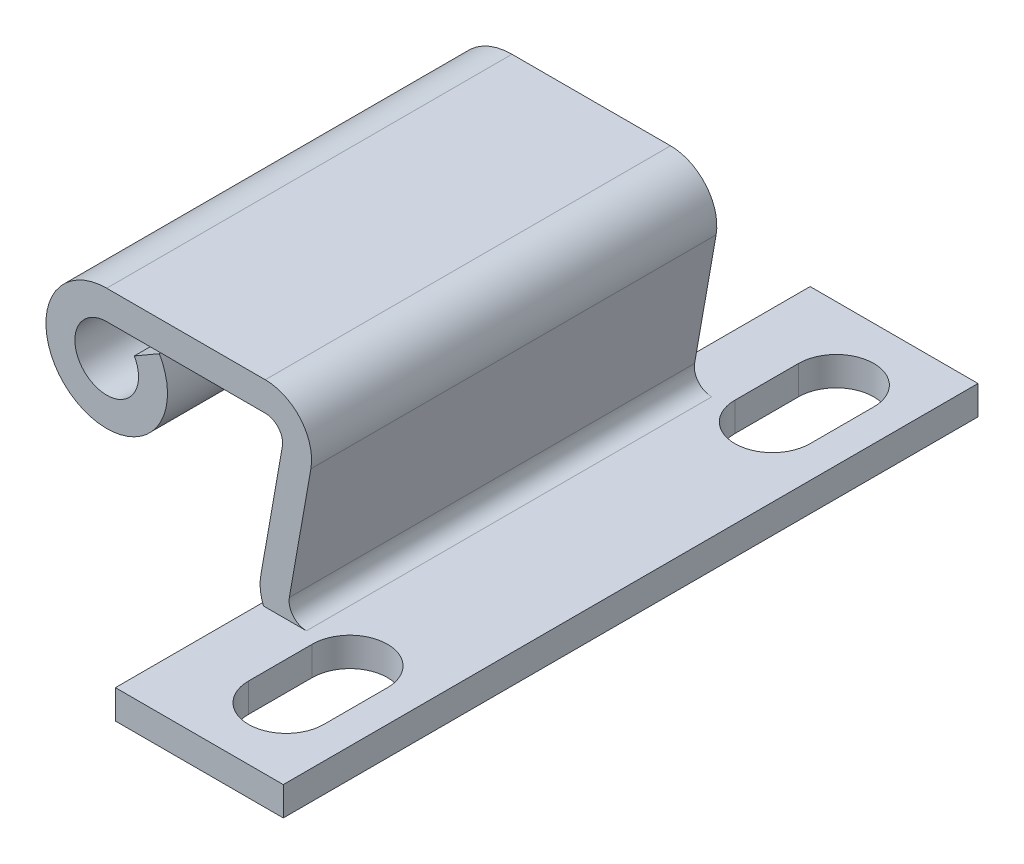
ISO-10303-21;
HEADER;
FILE_DESCRIPTION(('STEP AP214'),'2;1');
FILE_NAME('part.step','',(''),(''),'','','');
FILE_SCHEMA(('AUTOMOTIVE_DESIGN { 1 0 10303 214 1 1 1 1 }'));
ENDSEC;
DATA;
#1=APPLICATION_CONTEXT('core data for automotive mechanical design processes');
#2=APPLICATION_PROTOCOL_DEFINITION('international standard','automotive_design',2000,#1);
#3=PRODUCT_CONTEXT('',#1,'mechanical');
#4=PRODUCT('Part','Part','',(#3));
#5=PRODUCT_RELATED_PRODUCT_CATEGORY('part','',(#4));
#6=PRODUCT_DEFINITION_FORMATION('','',#4);
#7=PRODUCT_DEFINITION_CONTEXT('part definition',#1,'design');
#8=PRODUCT_DEFINITION('design','',#6,#7);
#9=PRODUCT_DEFINITION_SHAPE('','',#8);
#10=(LENGTH_UNIT() NAMED_UNIT(*) SI_UNIT(.MILLI.,.METRE.));
#11=(NAMED_UNIT(*) PLANE_ANGLE_UNIT() SI_UNIT($,.RADIAN.));
#12=(NAMED_UNIT(*) SI_UNIT($,.STERADIAN.) SOLID_ANGLE_UNIT());
#13=UNCERTAINTY_MEASURE_WITH_UNIT(LENGTH_MEASURE(1.E-05),#10,'distance_accuracy_value','');
#14=(GEOMETRIC_REPRESENTATION_CONTEXT(3) GLOBAL_UNCERTAINTY_ASSIGNED_CONTEXT((#13)) GLOBAL_UNIT_ASSIGNED_CONTEXT((#10,
#11,#12)) REPRESENTATION_CONTEXT('',''));
#15=CARTESIAN_POINT('',(0.,0.,0.));
#16=DIRECTION('',(0.,0.,1.));
#17=DIRECTION('',(1.,0.,0.));
#18=AXIS2_PLACEMENT_3D('',#15,#16,#17);
#19=CARTESIAN_POINT('',(17.25,-11.75,30.));
#20=DIRECTION('',(0.,1.,0.));
#21=DIRECTION('',(0.,0.,1.));
#22=AXIS2_PLACEMENT_3D('',#19,#20,#21);
#23=PLANE('',#22);
#24=DIRECTION('',(0.,0.,-1.));
#25=VECTOR('',#24,1.);
#26=CARTESIAN_POINT('',(27.75,-11.75,30.));
#27=LINE('',#26,#25);
#28=CARTESIAN_POINT('',(27.75,-11.75,30.));
#29=VERTEX_POINT('',#28);
#30=CARTESIAN_POINT('',(27.75,-11.75,-30.));
#31=VERTEX_POINT('',#30);
#32=EDGE_CURVE('E21',#29,#31,#27,.T.);
#33=ORIENTED_EDGE('',*,*,#32,.T.);
#34=DIRECTION('',(1.,0.,0.));
#35=VECTOR('',#34,1.);
#36=CARTESIAN_POINT('',(17.25,-11.75,-30.));
#37=LINE('',#36,#35);
#38=CARTESIAN_POINT('',(13.25,-11.75,-30.));
#39=VERTEX_POINT('',#38);
#40=EDGE_CURVE('E317',#39,#31,#37,.T.);
#41=ORIENTED_EDGE('',*,*,#40,.F.);
#42=DIRECTION('',(0.,0.,1.));
#43=VECTOR('',#42,1.);
#44=CARTESIAN_POINT('',(13.25,-11.75,-30.));
#45=LINE('',#44,#43);
#46=CARTESIAN_POINT('',(13.25,-11.75,30.));
#47=VERTEX_POINT('',#46);
#48=EDGE_CURVE('E247',#39,#47,#45,.T.);
#49=ORIENTED_EDGE('',*,*,#48,.T.);
#50=DIRECTION('',(1.,0.,0.));
#51=VECTOR('',#50,1.);
#52=CARTESIAN_POINT('',(17.25,-11.75,30.));
#53=LINE('',#52,#51);
#54=EDGE_CURVE('E326',#47,#29,#53,.T.);
#55=ORIENTED_EDGE('',*,*,#54,.T.);
#56=EDGE_LOOP('',(#33,#41,#49,#55));
#57=FACE_BOUND('',#56,.T.);
#58=DIRECTION('',(0.,0.,-1.));
#59=VECTOR('',#58,1.);
#60=CARTESIAN_POINT('',(13.5419007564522,-11.75,30.));
#61=LINE('',#60,#59);
#62=CARTESIAN_POINT('',(13.5419007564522,-11.75,-17.5));
#63=VERTEX_POINT('',#62);
#64=CARTESIAN_POINT('',(13.5419007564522,-11.75,17.5));
#65=VERTEX_POINT('',#64);
#66=EDGE_CURVE('E253',#63,#65,#61,.F.);
#67=ORIENTED_EDGE('',*,*,#66,.F.);
#68=DIRECTION('',(1.,0.,0.));
#69=VECTOR('',#68,1.);
#70=CARTESIAN_POINT('',(-5.25,-11.75,-17.5));
#71=LINE('',#70,#69);
#72=CARTESIAN_POINT('',(17.25,-11.75,-17.5));
#73=VERTEX_POINT('',#72);
#74=EDGE_CURVE('E255',#63,#73,#71,.T.);
#75=ORIENTED_EDGE('',*,*,#74,.T.);
#76=DIRECTION('',(0.,0.,-1.));
#77=VECTOR('',#76,1.);
#78=CARTESIAN_POINT('',(17.25,-11.75,30.));
#79=LINE('',#78,#77);
#80=CARTESIAN_POINT('',(17.25,-11.75,17.5));
#81=VERTEX_POINT('',#80);
#82=EDGE_CURVE('E361',#81,#73,#79,.T.);
#83=ORIENTED_EDGE('',*,*,#82,.F.);
#84=DIRECTION('',(1.,0.,0.));
#85=VECTOR('',#84,1.);
#86=CARTESIAN_POINT('',(-5.25,-11.75,17.5));
#87=LINE('',#86,#85);
#88=EDGE_CURVE('E285',#65,#81,#87,.T.);
#89=ORIENTED_EDGE('',*,*,#88,.F.);
#90=EDGE_LOOP('',(#67,#75,#83,#89));
#91=FACE_BOUND('',#90,.T.);
#92=CARTESIAN_POINT('',(21.75,-11.75,18.25));
#93=DIRECTION('',(0.,1.,0.));
#94=DIRECTION('',(0.,0.,1.));
#95=AXIS2_PLACEMENT_3D('',#92,#93,#94);
#96=CIRCLE('',#95,3.25);
#97=CARTESIAN_POINT('',(25.,-11.75,18.25));
#98=VERTEX_POINT('',#97);
#99=CARTESIAN_POINT('',(18.5,-11.75,18.25));
#100=VERTEX_POINT('',#99);
#101=EDGE_CURVE('E239',#98,#100,#96,.T.);
#102=ORIENTED_EDGE('',*,*,#101,.F.);
#103=DIRECTION('',(0.,0.,-1.));
#104=VECTOR('',#103,1.);
#105=CARTESIAN_POINT('',(25.,-11.75,30.));
#106=LINE('',#105,#104);
#107=CARTESIAN_POINT('',(25.,-11.75,23.75));
#108=VERTEX_POINT('',#107);
#109=EDGE_CURVE('E231',#108,#98,#106,.T.);
#110=ORIENTED_EDGE('',*,*,#109,.F.);
#111=CARTESIAN_POINT('',(21.75,-11.75,23.75));
#112=DIRECTION('',(0.,1.,0.));
#113=DIRECTION('',(0.,0.,1.));
#114=AXIS2_PLACEMENT_3D('',#111,#112,#113);
#115=CIRCLE('',#114,3.25);
#116=CARTESIAN_POINT('',(18.5,-11.75,23.75));
#117=VERTEX_POINT('',#116);
#118=EDGE_CURVE('E233',#117,#108,#115,.T.);
#119=ORIENTED_EDGE('',*,*,#118,.F.);
#120=DIRECTION('',(0.,0.,-1.));
#121=VECTOR('',#120,1.);
#122=CARTESIAN_POINT('',(18.5,-11.75,30.));
#123=LINE('',#122,#121);
#124=EDGE_CURVE('E236',#117,#100,#123,.T.);
#125=ORIENTED_EDGE('',*,*,#124,.T.);
#126=EDGE_LOOP('',(#102,#110,#119,#125));
#127=FACE_BOUND('',#126,.T.);
#128=DIRECTION('',(0.,0.,1.));
#129=VECTOR('',#128,1.);
#130=CARTESIAN_POINT('',(18.5,-11.75,30.));
#131=LINE('',#130,#129);
#132=CARTESIAN_POINT('',(18.5,-11.75,-23.75));
#133=VERTEX_POINT('',#132);
#134=CARTESIAN_POINT('',(18.5,-11.75,-18.25));
#135=VERTEX_POINT('',#134);
#136=EDGE_CURVE('E208',#133,#135,#131,.T.);
#137=ORIENTED_EDGE('',*,*,#136,.F.);
#138=CARTESIAN_POINT('',(21.75,-11.75,-23.75));
#139=DIRECTION('',(0.,1.,0.));
#140=DIRECTION('',(0.,0.,1.));
#141=AXIS2_PLACEMENT_3D('',#138,#139,#140);
#142=CIRCLE('',#141,3.25);
#143=CARTESIAN_POINT('',(25.,-11.75,-23.75));
#144=VERTEX_POINT('',#143);
#145=EDGE_CURVE('E177',#133,#144,#142,.F.);
#146=ORIENTED_EDGE('',*,*,#145,.T.);
#147=DIRECTION('',(0.,0.,1.));
#148=VECTOR('',#147,1.);
#149=CARTESIAN_POINT('',(25.,-11.75,30.));
#150=LINE('',#149,#148);
#151=CARTESIAN_POINT('',(25.,-11.75,-18.25));
#152=VERTEX_POINT('',#151);
#153=EDGE_CURVE('E180',#144,#152,#150,.T.);
#154=ORIENTED_EDGE('',*,*,#153,.T.);
#155=CARTESIAN_POINT('',(21.75,-11.75,-18.25));
#156=DIRECTION('',(0.,1.,0.));
#157=DIRECTION('',(0.,0.,1.));
#158=AXIS2_PLACEMENT_3D('',#155,#156,#157);
#159=CIRCLE('',#158,3.25);
#160=EDGE_CURVE('E205',#152,#135,#159,.F.);
#161=ORIENTED_EDGE('',*,*,#160,.T.);
#162=EDGE_LOOP('',(#137,#146,#154,#161));
#163=FACE_BOUND('',#162,.T.);
#164=ADVANCED_FACE('F14',(#57,#91,#127,#163),#23,.T.);
#165=CARTESIAN_POINT('',(17.25,-14.25,30.));
#166=DIRECTION('',(0.,1.,0.));
#167=DIRECTION('',(0.,0.,1.));
#168=AXIS2_PLACEMENT_3D('',#165,#166,#167);
#169=PLANE('',#168);
#170=DIRECTION('',(1.,0.,0.));
#171=VECTOR('',#170,1.);
#172=CARTESIAN_POINT('',(17.25,-14.25,30.));
#173=LINE('',#172,#171);
#174=CARTESIAN_POINT('',(13.25,-14.25,30.));
#175=VERTEX_POINT('',#174);
#176=CARTESIAN_POINT('',(27.75,-14.25,30.));
#177=VERTEX_POINT('',#176);
#178=EDGE_CURVE('E323',#175,#177,#173,.T.);
#179=ORIENTED_EDGE('',*,*,#178,.F.);
#180=DIRECTION('',(0.,0.,1.));
#181=VECTOR('',#180,1.);
#182=CARTESIAN_POINT('',(13.25,-14.25,-30.));
#183=LINE('',#182,#181);
#184=CARTESIAN_POINT('',(13.25,-14.25,-30.));
#185=VERTEX_POINT('',#184);
#186=EDGE_CURVE('E250',#185,#175,#183,.T.);
#187=ORIENTED_EDGE('',*,*,#186,.F.);
#188=DIRECTION('',(1.,0.,0.));
#189=VECTOR('',#188,1.);
#190=CARTESIAN_POINT('',(17.25,-14.25,-30.));
#191=LINE('',#190,#189);
#192=CARTESIAN_POINT('',(27.75,-14.25,-30.));
#193=VERTEX_POINT('',#192);
#194=EDGE_CURVE('E314',#185,#193,#191,.T.);
#195=ORIENTED_EDGE('',*,*,#194,.T.);
#196=DIRECTION('',(0.,0.,-1.));
#197=VECTOR('',#196,1.);
#198=CARTESIAN_POINT('',(27.75,-14.25,30.));
#199=LINE('',#198,#197);
#200=EDGE_CURVE('E329',#177,#193,#199,.T.);
#201=ORIENTED_EDGE('',*,*,#200,.F.);
#202=EDGE_LOOP('',(#179,#187,#195,#201));
#203=FACE_BOUND('',#202,.T.);
#204=DIRECTION('',(0.,0.,1.));
#205=VECTOR('',#204,1.);
#206=CARTESIAN_POINT('',(25.,-14.25,18.25));
#207=LINE('',#206,#205);
#208=CARTESIAN_POINT('',(25.,-14.25,18.25));
#209=VERTEX_POINT('',#208);
#210=CARTESIAN_POINT('',(25.,-14.25,23.75));
#211=VERTEX_POINT('',#210);
#212=EDGE_CURVE('E213',#209,#211,#207,.T.);
#213=ORIENTED_EDGE('',*,*,#212,.F.);
#214=CARTESIAN_POINT('',(21.75,-14.25,18.25));
#215=DIRECTION('',(0.,-1.,0.));
#216=DIRECTION('',(0.,0.,-1.));
#217=AXIS2_PLACEMENT_3D('',#214,#215,#216);
#218=CIRCLE('',#217,3.25);
#219=CARTESIAN_POINT('',(18.5,-14.25,18.25));
#220=VERTEX_POINT('',#219);
#221=EDGE_CURVE('E211',#220,#209,#218,.T.);
#222=ORIENTED_EDGE('',*,*,#221,.F.);
#223=DIRECTION('',(0.,0.,1.));
#224=VECTOR('',#223,1.);
#225=CARTESIAN_POINT('',(18.5,-14.25,18.25));
#226=LINE('',#225,#224);
#227=CARTESIAN_POINT('',(18.5,-14.25,23.75));
#228=VERTEX_POINT('',#227);
#229=EDGE_CURVE('E219',#220,#228,#226,.T.);
#230=ORIENTED_EDGE('',*,*,#229,.T.);
#231=CARTESIAN_POINT('',(21.75,-14.25,23.75));
#232=DIRECTION('',(0.,-1.,0.));
#233=DIRECTION('',(0.,0.,-1.));
#234=AXIS2_PLACEMENT_3D('',#231,#232,#233);
#235=CIRCLE('',#234,3.25);
#236=EDGE_CURVE('E216',#211,#228,#235,.T.);
#237=ORIENTED_EDGE('',*,*,#236,.F.);
#238=EDGE_LOOP('',(#213,#222,#230,#237));
#239=FACE_BOUND('',#238,.T.);
#240=CARTESIAN_POINT('',(21.75,-14.25,-23.75));
#241=DIRECTION('',(0.,1.,0.));
#242=DIRECTION('',(0.,0.,1.));
#243=AXIS2_PLACEMENT_3D('',#240,#241,#242);
#244=CIRCLE('',#243,3.25);
#245=CARTESIAN_POINT('',(25.,-14.25,-23.75));
#246=VERTEX_POINT('',#245);
#247=CARTESIAN_POINT('',(18.5,-14.25,-23.75));
#248=VERTEX_POINT('',#247);
#249=EDGE_CURVE('E36',#246,#248,#244,.T.);
#250=ORIENTED_EDGE('',*,*,#249,.T.);
#251=DIRECTION('',(0.,0.,-1.));
#252=VECTOR('',#251,1.);
#253=CARTESIAN_POINT('',(18.5,-14.25,-18.25));
#254=LINE('',#253,#252);
#255=CARTESIAN_POINT('',(18.5,-14.25,-18.25));
#256=VERTEX_POINT('',#255);
#257=EDGE_CURVE('E184',#256,#248,#254,.T.);
#258=ORIENTED_EDGE('',*,*,#257,.F.);
#259=CARTESIAN_POINT('',(21.75,-14.25,-18.25));
#260=DIRECTION('',(0.,1.,0.));
#261=DIRECTION('',(0.,0.,1.));
#262=AXIS2_PLACEMENT_3D('',#259,#260,#261);
#263=CIRCLE('',#262,3.25);
#264=CARTESIAN_POINT('',(25.,-14.25,-18.25));
#265=VERTEX_POINT('',#264);
#266=EDGE_CURVE('E190',#256,#265,#263,.T.);
#267=ORIENTED_EDGE('',*,*,#266,.T.);
#268=DIRECTION('',(0.,0.,-1.));
#269=VECTOR('',#268,1.);
#270=CARTESIAN_POINT('',(25.,-14.25,-18.25));
#271=LINE('',#270,#269);
#272=EDGE_CURVE('E194',#265,#246,#271,.T.);
#273=ORIENTED_EDGE('',*,*,#272,.T.);
#274=EDGE_LOOP('',(#250,#258,#267,#273));
#275=FACE_BOUND('',#274,.T.);
#276=ADVANCED_FACE('F193',(#203,#239,#275),#169,.F.);
#277=CARTESIAN_POINT('',(17.25,-10.25,30.));
#278=DIRECTION('',(0.,0.,-1.));
#279=DIRECTION('',(-1.,0.,0.));
#280=AXIS2_PLACEMENT_3D('',#277,#278,#279);
#281=CYLINDRICAL_SURFACE('',#280,4.);
#282=CARTESIAN_POINT('',(17.25,-10.25,-17.5));
#283=DIRECTION('',(0.,0.,1.));
#284=DIRECTION('',(0.,-1.,0.));
#285=AXIS2_PLACEMENT_3D('',#282,#283,#284);
#286=CIRCLE('',#285,4.);
#287=CARTESIAN_POINT('',(13.3107689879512,-9.55540728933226,-17.5));
#288=VERTEX_POINT('',#287);
#289=EDGE_CURVE('E258',#63,#288,#286,.F.);
#290=ORIENTED_EDGE('',*,*,#289,.F.);
#291=ORIENTED_EDGE('',*,*,#66,.T.);
#292=CARTESIAN_POINT('',(17.25,-10.25,17.5));
#293=DIRECTION('',(0.,0.,1.));
#294=DIRECTION('',(0.,-1.,0.));
#295=AXIS2_PLACEMENT_3D('',#292,#293,#294);
#296=CIRCLE('',#295,4.);
#297=CARTESIAN_POINT('',(13.3107689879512,-9.55540728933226,17.5));
#298=VERTEX_POINT('',#297);
#299=EDGE_CURVE('E9',#65,#298,#296,.F.);
#300=ORIENTED_EDGE('',*,*,#299,.T.);
#301=DIRECTION('',(0.,0.,-1.));
#302=VECTOR('',#301,1.);
#303=CARTESIAN_POINT('',(13.3107689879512,-9.55540728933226,30.));
#304=LINE('',#303,#302);
#305=EDGE_CURVE('E331',#298,#288,#304,.T.);
#306=ORIENTED_EDGE('',*,*,#305,.T.);
#307=EDGE_LOOP('',(#290,#291,#300,#306));
#308=FACE_BOUND('',#307,.T.);
#309=ADVANCED_FACE('F382',(#308),#281,.T.);
#310=CARTESIAN_POINT('',(17.25,-10.25,30.));
#311=DIRECTION('',(0.,0.,-1.));
#312=DIRECTION('',(-1.,0.,0.));
#313=AXIS2_PLACEMENT_3D('',#310,#311,#312);
#314=CYLINDRICAL_SURFACE('',#313,1.5);
#315=ORIENTED_EDGE('',*,*,#82,.T.);
#316=CARTESIAN_POINT('',(17.25,-10.25,-17.5));
#317=DIRECTION('',(0.,0.,1.));
#318=DIRECTION('',(0.,-1.,0.));
#319=AXIS2_PLACEMENT_3D('',#316,#317,#318);
#320=CIRCLE('',#319,1.5);
#321=CARTESIAN_POINT('',(15.7727883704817,-9.9895277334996,-17.5));
#322=VERTEX_POINT('',#321);
#323=EDGE_CURVE('E282',#73,#322,#320,.F.);
#324=ORIENTED_EDGE('',*,*,#323,.T.);
#325=DIRECTION('',(0.,0.,-1.));
#326=VECTOR('',#325,1.);
#327=CARTESIAN_POINT('',(15.7727883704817,-9.9895277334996,30.));
#328=LINE('',#327,#326);
#329=CARTESIAN_POINT('',(15.7727883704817,-9.9895277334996,17.5));
#330=VERTEX_POINT('',#329);
#331=EDGE_CURVE('E358',#330,#322,#328,.T.);
#332=ORIENTED_EDGE('',*,*,#331,.F.);
#333=CARTESIAN_POINT('',(17.25,-10.25,17.5));
#334=DIRECTION('',(0.,0.,1.));
#335=DIRECTION('',(0.,-1.,0.));
#336=AXIS2_PLACEMENT_3D('',#333,#334,#335);
#337=CIRCLE('',#336,1.5);
#338=EDGE_CURVE('E309',#81,#330,#337,.F.);
#339=ORIENTED_EDGE('',*,*,#338,.F.);
#340=EDGE_LOOP('',(#315,#324,#332,#339));
#341=FACE_BOUND('',#340,.T.);
#342=ADVANCED_FACE('F434',(#341),#314,.F.);
#343=CARTESIAN_POINT('',(17.6321449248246,0.555407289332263,30.));
#344=DIRECTION('',(0.984807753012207,-0.173648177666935,0.));
#345=DIRECTION('',(0.173648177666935,0.984807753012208,0.));
#346=AXIS2_PLACEMENT_3D('',#343,#344,#345);
#347=PLANE('',#346);
#348=DIRECTION('',(-0.173648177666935,-0.984807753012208,0.));
#349=VECTOR('',#348,1.);
#350=CARTESIAN_POINT('',(17.6321449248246,0.555407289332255,-17.5));
#351=LINE('',#350,#349);
#352=CARTESIAN_POINT('',(17.6321449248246,0.555407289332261,-17.5));
#353=VERTEX_POINT('',#352);
#354=EDGE_CURVE('E280',#353,#322,#351,.T.);
#355=ORIENTED_EDGE('',*,*,#354,.F.);
#356=DIRECTION('',(0.,0.,-1.));
#357=VECTOR('',#356,1.);
#358=CARTESIAN_POINT('',(17.6321449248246,0.555407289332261,30.));
#359=LINE('',#358,#357);
#360=CARTESIAN_POINT('',(17.6321449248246,0.555407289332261,17.5));
#361=VERTEX_POINT('',#360);
#362=EDGE_CURVE('E355',#361,#353,#359,.T.);
#363=ORIENTED_EDGE('',*,*,#362,.F.);
#364=DIRECTION('',(-0.173648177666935,-0.984807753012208,0.));
#365=VECTOR('',#364,1.);
#366=CARTESIAN_POINT('',(17.6321449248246,0.555407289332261,17.5));
#367=LINE('',#366,#365);
#368=EDGE_CURVE('E306',#361,#330,#367,.T.);
#369=ORIENTED_EDGE('',*,*,#368,.T.);
#370=ORIENTED_EDGE('',*,*,#331,.T.);
#371=EDGE_LOOP('',(#355,#363,#369,#370));
#372=FACE_BOUND('',#371,.T.);
#373=ADVANCED_FACE('F443',(#372),#347,.T.);
#374=CARTESIAN_POINT('',(13.6929139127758,1.25,30.));
#375=DIRECTION('',(0.,0.,-1.));
#376=DIRECTION('',(-1.,0.,0.));
#377=AXIS2_PLACEMENT_3D('',#374,#375,#376);
#378=CYLINDRICAL_SURFACE('',#377,4.);
#379=ORIENTED_EDGE('',*,*,#362,.T.);
#380=CARTESIAN_POINT('',(13.6929139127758,1.25,-17.5));
#381=DIRECTION('',(0.,0.,1.));
#382=DIRECTION('',(0.,-1.,0.));
#383=AXIS2_PLACEMENT_3D('',#380,#381,#382);
#384=CIRCLE('',#383,4.);
#385=CARTESIAN_POINT('',(13.6929139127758,5.25,-17.5));
#386=VERTEX_POINT('',#385);
#387=EDGE_CURVE('E277',#353,#386,#384,.T.);
#388=ORIENTED_EDGE('',*,*,#387,.T.);
#389=DIRECTION('',(0.,0.,-1.));
#390=VECTOR('',#389,1.);
#391=CARTESIAN_POINT('',(13.6929139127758,5.25,30.));
#392=LINE('',#391,#390);
#393=CARTESIAN_POINT('',(13.6929139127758,5.25,17.5));
#394=VERTEX_POINT('',#393);
#395=EDGE_CURVE('E352',#394,#386,#392,.T.);
#396=ORIENTED_EDGE('',*,*,#395,.F.);
#397=CARTESIAN_POINT('',(13.6929139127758,1.25,17.5));
#398=DIRECTION('',(0.,0.,1.));
#399=DIRECTION('',(0.,-1.,0.));
#400=AXIS2_PLACEMENT_3D('',#397,#398,#399);
#401=CIRCLE('',#400,4.);
#402=EDGE_CURVE('E304',#361,#394,#401,.T.);
#403=ORIENTED_EDGE('',*,*,#402,.F.);
#404=EDGE_LOOP('',(#379,#388,#396,#403));
#405=FACE_BOUND('',#404,.T.);
#406=ADVANCED_FACE('F451',(#405),#378,.T.);
#407=CARTESIAN_POINT('',(0.,5.25,30.));
#408=DIRECTION('',(0.,1.,0.));
#409=DIRECTION('',(0.,0.,1.));
#410=AXIS2_PLACEMENT_3D('',#407,#408,#409);
#411=PLANE('',#410);
#412=DIRECTION('',(1.,0.,0.));
#413=VECTOR('',#412,1.);
#414=CARTESIAN_POINT('',(0.,5.25,-17.5));
#415=LINE('',#414,#413);
#416=CARTESIAN_POINT('',(0.,5.25,-17.5));
#417=VERTEX_POINT('',#416);
#418=EDGE_CURVE('E275',#417,#386,#415,.T.);
#419=ORIENTED_EDGE('',*,*,#418,.F.);
#420=DIRECTION('',(0.,0.,-1.));
#421=VECTOR('',#420,1.);
#422=CARTESIAN_POINT('',(0.,5.25,30.));
#423=LINE('',#422,#421);
#424=CARTESIAN_POINT('',(0.,5.25,17.5));
#425=VERTEX_POINT('',#424);
#426=EDGE_CURVE('E349',#425,#417,#423,.T.);
#427=ORIENTED_EDGE('',*,*,#426,.F.);
#428=DIRECTION('',(1.,0.,0.));
#429=VECTOR('',#428,1.);
#430=CARTESIAN_POINT('',(0.,5.25,17.5));
#431=LINE('',#430,#429);
#432=EDGE_CURVE('E301',#425,#394,#431,.T.);
#433=ORIENTED_EDGE('',*,*,#432,.T.);
#434=ORIENTED_EDGE('',*,*,#395,.T.);
#435=EDGE_LOOP('',(#419,#427,#433,#434));
#436=FACE_BOUND('',#435,.T.);
#437=ADVANCED_FACE('F460',(#436),#411,.T.);
#438=CARTESIAN_POINT('',(0.,0.,30.));
#439=DIRECTION('',(0.,0.,-1.));
#440=DIRECTION('',(-1.,0.,0.));
#441=AXIS2_PLACEMENT_3D('',#438,#439,#440);
#442=CYLINDRICAL_SURFACE('',#441,5.25);
#443=CARTESIAN_POINT('',(0.,0.,-17.5));
#444=DIRECTION('',(0.,0.,1.));
#445=DIRECTION('',(0.,-1.,0.));
#446=AXIS2_PLACEMENT_3D('',#443,#444,#445);
#447=CIRCLE('',#446,5.25);
#448=CARTESIAN_POINT('',(4.5466333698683,2.625,-17.5));
#449=VERTEX_POINT('',#448);
#450=EDGE_CURVE('E273',#417,#449,#447,.T.);
#451=ORIENTED_EDGE('',*,*,#450,.T.);
#452=DIRECTION('',(0.,0.,-1.));
#453=VECTOR('',#452,1.);
#454=CARTESIAN_POINT('',(4.5466333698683,2.625,30.));
#455=LINE('',#454,#453);
#456=CARTESIAN_POINT('',(4.5466333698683,2.625,17.5));
#457=VERTEX_POINT('',#456);
#458=EDGE_CURVE('E346',#457,#449,#455,.T.);
#459=ORIENTED_EDGE('',*,*,#458,.F.);
#460=CARTESIAN_POINT('',(0.,0.,17.5));
#461=DIRECTION('',(0.,0.,1.));
#462=DIRECTION('',(0.,-1.,0.));
#463=AXIS2_PLACEMENT_3D('',#460,#461,#462);
#464=CIRCLE('',#463,5.25);
#465=EDGE_CURVE('E299',#425,#457,#464,.T.);
#466=ORIENTED_EDGE('',*,*,#465,.F.);
#467=ORIENTED_EDGE('',*,*,#426,.T.);
#468=EDGE_LOOP('',(#451,#459,#466,#467));
#469=FACE_BOUND('',#468,.T.);
#470=ADVANCED_FACE('F469',(#469),#442,.T.);
#471=CARTESIAN_POINT('',(4.5466333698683,2.625,30.));
#472=DIRECTION('',(0.5,-0.866025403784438,0.));
#473=DIRECTION('',(0.866025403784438,0.5,0.));
#474=AXIS2_PLACEMENT_3D('',#471,#472,#473);
#475=PLANE('',#474);
#476=ORIENTED_EDGE('',*,*,#458,.T.);
#477=DIRECTION('',(-0.866025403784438,-0.5,0.));
#478=VECTOR('',#477,1.);
#479=CARTESIAN_POINT('',(4.5466333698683,2.625,-17.5));
#480=LINE('',#479,#478);
#481=CARTESIAN_POINT('',(2.38156986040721,1.375,-17.5));
#482=VERTEX_POINT('',#481);
#483=EDGE_CURVE('E270',#449,#482,#480,.T.);
#484=ORIENTED_EDGE('',*,*,#483,.T.);
#485=DIRECTION('',(0.,0.,-1.));
#486=VECTOR('',#485,1.);
#487=CARTESIAN_POINT('',(2.38156986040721,1.375,30.));
#488=LINE('',#487,#486);
#489=CARTESIAN_POINT('',(2.38156986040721,1.375,17.5));
#490=VERTEX_POINT('',#489);
#491=EDGE_CURVE('E343',#490,#482,#488,.T.);
#492=ORIENTED_EDGE('',*,*,#491,.F.);
#493=DIRECTION('',(-0.866025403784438,-0.5,0.));
#494=VECTOR('',#493,1.);
#495=CARTESIAN_POINT('',(4.5466333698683,2.625,17.5));
#496=LINE('',#495,#494);
#497=EDGE_CURVE('E297',#457,#490,#496,.T.);
#498=ORIENTED_EDGE('',*,*,#497,.F.);
#499=EDGE_LOOP('',(#476,#484,#492,#498));
#500=FACE_BOUND('',#499,.T.);
#501=ADVANCED_FACE('F478',(#500),#475,.F.);
#502=CARTESIAN_POINT('',(0.,0.,30.));
#503=DIRECTION('',(0.,0.,-1.));
#504=DIRECTION('',(-1.,0.,0.));
#505=AXIS2_PLACEMENT_3D('',#502,#503,#504);
#506=CYLINDRICAL_SURFACE('',#505,2.75);
#507=CARTESIAN_POINT('',(0.,0.,-17.5));
#508=DIRECTION('',(0.,0.,1.));
#509=DIRECTION('',(0.,-1.,0.));
#510=AXIS2_PLACEMENT_3D('',#507,#508,#509);
#511=CIRCLE('',#510,2.75);
#512=CARTESIAN_POINT('',(0.,2.75,-17.5));
#513=VERTEX_POINT('',#512);
#514=EDGE_CURVE('E268',#513,#482,#511,.T.);
#515=ORIENTED_EDGE('',*,*,#514,.F.);
#516=DIRECTION('',(0.,0.,-1.));
#517=VECTOR('',#516,1.);
#518=CARTESIAN_POINT('',(0.,2.75,30.));
#519=LINE('',#518,#517);
#520=CARTESIAN_POINT('',(0.,2.75,17.5));
#521=VERTEX_POINT('',#520);
#522=EDGE_CURVE('E340',#521,#513,#519,.T.);
#523=ORIENTED_EDGE('',*,*,#522,.F.);
#524=CARTESIAN_POINT('',(0.,0.,17.5));
#525=DIRECTION('',(0.,0.,1.));
#526=DIRECTION('',(0.,-1.,0.));
#527=AXIS2_PLACEMENT_3D('',#524,#525,#526);
#528=CIRCLE('',#527,2.75);
#529=EDGE_CURVE('E294',#521,#490,#528,.T.);
#530=ORIENTED_EDGE('',*,*,#529,.T.);
#531=ORIENTED_EDGE('',*,*,#491,.T.);
#532=EDGE_LOOP('',(#515,#523,#530,#531));
#533=FACE_BOUND('',#532,.T.);
#534=ADVANCED_FACE('F487',(#533),#506,.F.);
#535=CARTESIAN_POINT('',(0.,2.75,30.));
#536=DIRECTION('',(0.,1.,0.));
#537=DIRECTION('',(0.,0.,1.));
#538=AXIS2_PLACEMENT_3D('',#535,#536,#537);
#539=PLANE('',#538);
#540=ORIENTED_EDGE('',*,*,#522,.T.);
#541=DIRECTION('',(1.,0.,0.));
#542=VECTOR('',#541,1.);
#543=CARTESIAN_POINT('',(0.,2.75,-17.5));
#544=LINE('',#543,#542);
#545=CARTESIAN_POINT('',(13.6929139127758,2.75,-17.5));
#546=VERTEX_POINT('',#545);
#547=EDGE_CURVE('E265',#513,#546,#544,.T.);
#548=ORIENTED_EDGE('',*,*,#547,.T.);
#549=DIRECTION('',(0.,0.,-1.));
#550=VECTOR('',#549,1.);
#551=CARTESIAN_POINT('',(13.6929139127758,2.75,30.));
#552=LINE('',#551,#550);
#553=CARTESIAN_POINT('',(13.6929139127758,2.75,17.5));
#554=VERTEX_POINT('',#553);
#555=EDGE_CURVE('E337',#554,#546,#552,.T.);
#556=ORIENTED_EDGE('',*,*,#555,.F.);
#557=DIRECTION('',(1.,0.,0.));
#558=VECTOR('',#557,1.);
#559=CARTESIAN_POINT('',(0.,2.75,17.5));
#560=LINE('',#559,#558);
#561=EDGE_CURVE('E292',#521,#554,#560,.T.);
#562=ORIENTED_EDGE('',*,*,#561,.F.);
#563=EDGE_LOOP('',(#540,#548,#556,#562));
#564=FACE_BOUND('',#563,.T.);
#565=ADVANCED_FACE('F496',(#564),#539,.F.);
#566=CARTESIAN_POINT('',(13.6929139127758,1.25,30.));
#567=DIRECTION('',(0.,0.,-1.));
#568=DIRECTION('',(-1.,0.,0.));
#569=AXIS2_PLACEMENT_3D('',#566,#567,#568);
#570=CYLINDRICAL_SURFACE('',#569,1.5);
#571=CARTESIAN_POINT('',(13.6929139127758,1.25,-17.5));
#572=DIRECTION('',(0.,0.,1.));
#573=DIRECTION('',(0.,-1.,0.));
#574=AXIS2_PLACEMENT_3D('',#571,#572,#573);
#575=CIRCLE('',#574,1.5);
#576=CARTESIAN_POINT('',(15.1701255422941,0.989527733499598,-17.5));
#577=VERTEX_POINT('',#576);
#578=EDGE_CURVE('E263',#577,#546,#575,.T.);
#579=ORIENTED_EDGE('',*,*,#578,.F.);
#580=DIRECTION('',(0.,0.,-1.));
#581=VECTOR('',#580,1.);
#582=CARTESIAN_POINT('',(15.1701255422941,0.989527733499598,30.));
#583=LINE('',#582,#581);
#584=CARTESIAN_POINT('',(15.1701255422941,0.989527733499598,17.5));
#585=VERTEX_POINT('',#584);
#586=EDGE_CURVE('E334',#585,#577,#583,.T.);
#587=ORIENTED_EDGE('',*,*,#586,.F.);
#588=CARTESIAN_POINT('',(13.6929139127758,1.25,17.5));
#589=DIRECTION('',(0.,0.,1.));
#590=DIRECTION('',(0.,-1.,0.));
#591=AXIS2_PLACEMENT_3D('',#588,#589,#590);
#592=CIRCLE('',#591,1.5);
#593=EDGE_CURVE('E289',#585,#554,#592,.T.);
#594=ORIENTED_EDGE('',*,*,#593,.T.);
#595=ORIENTED_EDGE('',*,*,#555,.T.);
#596=EDGE_LOOP('',(#579,#587,#594,#595));
#597=FACE_BOUND('',#596,.T.);
#598=ADVANCED_FACE('F505',(#597),#570,.F.);
#599=CARTESIAN_POINT('',(15.1701255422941,0.989527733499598,30.));
#600=DIRECTION('',(0.984807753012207,-0.173648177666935,0.));
#601=DIRECTION('',(0.173648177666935,0.984807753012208,0.));
#602=AXIS2_PLACEMENT_3D('',#599,#600,#601);
#603=PLANE('',#602);
#604=ORIENTED_EDGE('',*,*,#586,.T.);
#605=DIRECTION('',(-0.173648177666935,-0.984807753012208,0.));
#606=VECTOR('',#605,1.);
#607=CARTESIAN_POINT('',(15.1701255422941,0.989527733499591,-17.5));
#608=LINE('',#607,#606);
#609=EDGE_CURVE('E260',#577,#288,#608,.T.);
#610=ORIENTED_EDGE('',*,*,#609,.T.);
#611=ORIENTED_EDGE('',*,*,#305,.F.);
#612=DIRECTION('',(-0.173648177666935,-0.984807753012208,0.));
#613=VECTOR('',#612,1.);
#614=CARTESIAN_POINT('',(15.1701255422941,0.989527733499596,17.5));
#615=LINE('',#614,#613);
#616=EDGE_CURVE('E287',#585,#298,#615,.T.);
#617=ORIENTED_EDGE('',*,*,#616,.F.);
#618=EDGE_LOOP('',(#604,#610,#611,#617));
#619=FACE_BOUND('',#618,.T.);
#620=ADVANCED_FACE('F514',(#619),#603,.F.);
#621=CARTESIAN_POINT('',(17.25,-10.25,30.));
#622=DIRECTION('',(0.,0.,-1.));
#623=DIRECTION('',(-1.,0.,0.));
#624=AXIS2_PLACEMENT_3D('',#621,#622,#623);
#625=PLANE('',#624);
#626=ORIENTED_EDGE('',*,*,#54,.F.);
#627=DIRECTION('',(0.,1.,0.));
#628=VECTOR('',#627,1.);
#629=CARTESIAN_POINT('',(13.25,-14.25,30.));
#630=LINE('',#629,#628);
#631=EDGE_CURVE('E241',#175,#47,#630,.T.);
#632=ORIENTED_EDGE('',*,*,#631,.F.);
#633=ORIENTED_EDGE('',*,*,#178,.T.);
#634=DIRECTION('',(0.,-1.,0.));
#635=VECTOR('',#634,1.);
#636=CARTESIAN_POINT('',(27.75,-11.75,30.));
#637=LINE('',#636,#635);
#638=EDGE_CURVE('E320',#29,#177,#637,.T.);
#639=ORIENTED_EDGE('',*,*,#638,.F.);
#640=EDGE_LOOP('',(#626,#632,#633,#639));
#641=FACE_BOUND('',#640,.T.);
#642=ADVANCED_FACE('F378',(#641),#625,.F.);
#643=CARTESIAN_POINT('',(27.75,-11.75,30.));
#644=DIRECTION('',(1.,0.,0.));
#645=DIRECTION('',(0.,0.,-1.));
#646=AXIS2_PLACEMENT_3D('',#643,#644,#645);
#647=PLANE('',#646);
#648=ORIENTED_EDGE('',*,*,#32,.F.);
#649=ORIENTED_EDGE('',*,*,#638,.T.);
#650=ORIENTED_EDGE('',*,*,#200,.T.);
#651=DIRECTION('',(0.,-1.,0.));
#652=VECTOR('',#651,1.);
#653=CARTESIAN_POINT('',(27.75,-11.75,-30.));
#654=LINE('',#653,#652);
#655=EDGE_CURVE('E311',#31,#193,#654,.T.);
#656=ORIENTED_EDGE('',*,*,#655,.F.);
#657=EDGE_LOOP('',(#648,#649,#650,#656));
#658=FACE_BOUND('',#657,.T.);
#659=ADVANCED_FACE('F369',(#658),#647,.T.);
#660=CARTESIAN_POINT('',(17.25,-10.25,-30.));
#661=DIRECTION('',(0.,0.,-1.));
#662=DIRECTION('',(-1.,0.,0.));
#663=AXIS2_PLACEMENT_3D('',#660,#661,#662);
#664=PLANE('',#663);
#665=ORIENTED_EDGE('',*,*,#194,.F.);
#666=DIRECTION('',(0.,1.,0.));
#667=VECTOR('',#666,1.);
#668=CARTESIAN_POINT('',(13.25,-14.25,-30.));
#669=LINE('',#668,#667);
#670=EDGE_CURVE('E244',#185,#39,#669,.T.);
#671=ORIENTED_EDGE('',*,*,#670,.T.);
#672=ORIENTED_EDGE('',*,*,#40,.T.);
#673=ORIENTED_EDGE('',*,*,#655,.T.);
#674=EDGE_LOOP('',(#665,#671,#672,#673));
#675=FACE_BOUND('',#674,.T.);
#676=ADVANCED_FACE('F371',(#675),#664,.T.);
#677=CARTESIAN_POINT('',(-5.25,10.,17.5));
#678=DIRECTION('',(0.,0.,1.));
#679=DIRECTION('',(0.,-1.,0.));
#680=AXIS2_PLACEMENT_3D('',#677,#678,#679);
#681=PLANE('',#680);
#682=ORIENTED_EDGE('',*,*,#338,.T.);
#683=ORIENTED_EDGE('',*,*,#368,.F.);
#684=ORIENTED_EDGE('',*,*,#402,.T.);
#685=ORIENTED_EDGE('',*,*,#432,.F.);
#686=ORIENTED_EDGE('',*,*,#465,.T.);
#687=ORIENTED_EDGE('',*,*,#497,.T.);
#688=ORIENTED_EDGE('',*,*,#529,.F.);
#689=ORIENTED_EDGE('',*,*,#561,.T.);
#690=ORIENTED_EDGE('',*,*,#593,.F.);
#691=ORIENTED_EDGE('',*,*,#616,.T.);
#692=ORIENTED_EDGE('',*,*,#299,.F.);
#693=ORIENTED_EDGE('',*,*,#88,.T.);
#694=EDGE_LOOP('',(#682,#683,#684,#685,#686,#687,#688,#689,#690,#691,#692,#693));
#695=FACE_BOUND('',#694,.T.);
#696=ADVANCED_FACE('F545',(#695),#681,.T.);
#697=CARTESIAN_POINT('',(-5.25,10.,-17.5));
#698=DIRECTION('',(0.,0.,1.));
#699=DIRECTION('',(0.,-1.,0.));
#700=AXIS2_PLACEMENT_3D('',#697,#698,#699);
#701=PLANE('',#700);
#702=ORIENTED_EDGE('',*,*,#74,.F.);
#703=ORIENTED_EDGE('',*,*,#289,.T.);
#704=ORIENTED_EDGE('',*,*,#609,.F.);
#705=ORIENTED_EDGE('',*,*,#578,.T.);
#706=ORIENTED_EDGE('',*,*,#547,.F.);
#707=ORIENTED_EDGE('',*,*,#514,.T.);
#708=ORIENTED_EDGE('',*,*,#483,.F.);
#709=ORIENTED_EDGE('',*,*,#450,.F.);
#710=ORIENTED_EDGE('',*,*,#418,.T.);
#711=ORIENTED_EDGE('',*,*,#387,.F.);
#712=ORIENTED_EDGE('',*,*,#354,.T.);
#713=ORIENTED_EDGE('',*,*,#323,.F.);
#714=EDGE_LOOP('',(#702,#703,#704,#705,#706,#707,#708,#709,#710,#711,#712,#713));
#715=FACE_BOUND('',#714,.T.);
#716=ADVANCED_FACE('F553',(#715),#701,.F.);
#717=CARTESIAN_POINT('',(13.25,-14.25,-30.));
#718=DIRECTION('',(1.,0.,0.));
#719=DIRECTION('',(0.,0.,-1.));
#720=AXIS2_PLACEMENT_3D('',#717,#718,#719);
#721=PLANE('',#720);
#722=ORIENTED_EDGE('',*,*,#48,.F.);
#723=ORIENTED_EDGE('',*,*,#670,.F.);
#724=ORIENTED_EDGE('',*,*,#186,.T.);
#725=ORIENTED_EDGE('',*,*,#631,.T.);
#726=EDGE_LOOP('',(#722,#723,#724,#725));
#727=FACE_BOUND('',#726,.T.);
#728=ADVANCED_FACE('F375',(#727),#721,.F.);
#729=CARTESIAN_POINT('',(21.75,5.25,18.25));
#730=DIRECTION('',(0.,-1.,0.));
#731=DIRECTION('',(0.,0.,-1.));
#732=AXIS2_PLACEMENT_3D('',#729,#730,#731);
#733=CYLINDRICAL_SURFACE('',#732,3.25);
#734=ORIENTED_EDGE('',*,*,#101,.T.);
#735=DIRECTION('',(0.,-1.,0.));
#736=VECTOR('',#735,1.);
#737=CARTESIAN_POINT('',(18.5,5.25,18.25));
#738=LINE('',#737,#736);
#739=EDGE_CURVE('E229',#100,#220,#738,.T.);
#740=ORIENTED_EDGE('',*,*,#739,.T.);
#741=ORIENTED_EDGE('',*,*,#221,.T.);
#742=DIRECTION('',(0.,-1.,0.));
#743=VECTOR('',#742,1.);
#744=CARTESIAN_POINT('',(25.,5.25,18.25));
#745=LINE('',#744,#743);
#746=EDGE_CURVE('E222',#98,#209,#745,.T.);
#747=ORIENTED_EDGE('',*,*,#746,.F.);
#748=EDGE_LOOP('',(#734,#740,#741,#747));
#749=FACE_BOUND('',#748,.T.);
#750=ADVANCED_FACE('F393',(#749),#733,.F.);
#751=CARTESIAN_POINT('',(18.5,5.25,18.25));
#752=DIRECTION('',(1.,0.,0.));
#753=DIRECTION('',(0.,0.,-1.));
#754=AXIS2_PLACEMENT_3D('',#751,#752,#753);
#755=PLANE('',#754);
#756=DIRECTION('',(0.,-1.,0.));
#757=VECTOR('',#756,1.);
#758=CARTESIAN_POINT('',(18.5,5.25,23.75));
#759=LINE('',#758,#757);
#760=EDGE_CURVE('E227',#117,#228,#759,.T.);
#761=ORIENTED_EDGE('',*,*,#760,.T.);
#762=ORIENTED_EDGE('',*,*,#229,.F.);
#763=ORIENTED_EDGE('',*,*,#739,.F.);
#764=ORIENTED_EDGE('',*,*,#124,.F.);
#765=EDGE_LOOP('',(#761,#762,#763,#764));
#766=FACE_BOUND('',#765,.T.);
#767=ADVANCED_FACE('F400',(#766),#755,.T.);
#768=CARTESIAN_POINT('',(21.75,5.25,23.75));
#769=DIRECTION('',(0.,-1.,0.));
#770=DIRECTION('',(0.,0.,-1.));
#771=AXIS2_PLACEMENT_3D('',#768,#769,#770);
#772=CYLINDRICAL_SURFACE('',#771,3.25);
#773=ORIENTED_EDGE('',*,*,#118,.T.);
#774=DIRECTION('',(0.,-1.,0.));
#775=VECTOR('',#774,1.);
#776=CARTESIAN_POINT('',(25.,5.25,23.75));
#777=LINE('',#776,#775);
#778=EDGE_CURVE('E225',#108,#211,#777,.T.);
#779=ORIENTED_EDGE('',*,*,#778,.T.);
#780=ORIENTED_EDGE('',*,*,#236,.T.);
#781=ORIENTED_EDGE('',*,*,#760,.F.);
#782=EDGE_LOOP('',(#773,#779,#780,#781));
#783=FACE_BOUND('',#782,.T.);
#784=ADVANCED_FACE('F403',(#783),#772,.F.);
#785=CARTESIAN_POINT('',(25.,5.25,18.25));
#786=DIRECTION('',(1.,0.,0.));
#787=DIRECTION('',(0.,0.,-1.));
#788=AXIS2_PLACEMENT_3D('',#785,#786,#787);
#789=PLANE('',#788);
#790=ORIENTED_EDGE('',*,*,#109,.T.);
#791=ORIENTED_EDGE('',*,*,#746,.T.);
#792=ORIENTED_EDGE('',*,*,#212,.T.);
#793=ORIENTED_EDGE('',*,*,#778,.F.);
#794=EDGE_LOOP('',(#790,#791,#792,#793));
#795=FACE_BOUND('',#794,.T.);
#796=ADVANCED_FACE('F388',(#795),#789,.F.);
#797=CARTESIAN_POINT('',(21.75,5.25,-23.75));
#798=DIRECTION('',(0.,-1.,0.));
#799=DIRECTION('',(0.,0.,-1.));
#800=AXIS2_PLACEMENT_3D('',#797,#798,#799);
#801=CYLINDRICAL_SURFACE('',#800,3.25);
#802=DIRECTION('',(0.,-1.,0.));
#803=VECTOR('',#802,1.);
#804=CARTESIAN_POINT('',(18.5,5.25,-23.75));
#805=LINE('',#804,#803);
#806=EDGE_CURVE('E173',#133,#248,#805,.T.);
#807=ORIENTED_EDGE('',*,*,#806,.T.);
#808=ORIENTED_EDGE('',*,*,#249,.F.);
#809=DIRECTION('',(0.,-1.,0.));
#810=VECTOR('',#809,1.);
#811=CARTESIAN_POINT('',(25.,5.25,-23.75));
#812=LINE('',#811,#810);
#813=EDGE_CURVE('E199',#144,#246,#812,.T.);
#814=ORIENTED_EDGE('',*,*,#813,.F.);
#815=ORIENTED_EDGE('',*,*,#145,.F.);
#816=EDGE_LOOP('',(#807,#808,#814,#815));
#817=FACE_BOUND('',#816,.T.);
#818=ADVANCED_FACE('F175',(#817),#801,.F.);
#819=CARTESIAN_POINT('',(18.5,5.25,-18.25));
#820=DIRECTION('',(-1.,0.,0.));
#821=DIRECTION('',(0.,0.,1.));
#822=AXIS2_PLACEMENT_3D('',#819,#820,#821);
#823=PLANE('',#822);
#824=ORIENTED_EDGE('',*,*,#136,.T.);
#825=DIRECTION('',(0.,-1.,0.));
#826=VECTOR('',#825,1.);
#827=CARTESIAN_POINT('',(18.5,5.25,-18.25));
#828=LINE('',#827,#826);
#829=EDGE_CURVE('E181',#135,#256,#828,.T.);
#830=ORIENTED_EDGE('',*,*,#829,.T.);
#831=ORIENTED_EDGE('',*,*,#257,.T.);
#832=ORIENTED_EDGE('',*,*,#806,.F.);
#833=EDGE_LOOP('',(#824,#830,#831,#832));
#834=FACE_BOUND('',#833,.T.);
#835=ADVANCED_FACE('F185',(#834),#823,.F.);
#836=CARTESIAN_POINT('',(21.75,5.25,-18.25));
#837=DIRECTION('',(0.,-1.,0.));
#838=DIRECTION('',(0.,0.,-1.));
#839=AXIS2_PLACEMENT_3D('',#836,#837,#838);
#840=CYLINDRICAL_SURFACE('',#839,3.25);
#841=DIRECTION('',(0.,-1.,0.));
#842=VECTOR('',#841,1.);
#843=CARTESIAN_POINT('',(25.,5.25,-18.25));
#844=LINE('',#843,#842);
#845=EDGE_CURVE('E28',#152,#265,#844,.T.);
#846=ORIENTED_EDGE('',*,*,#845,.T.);
#847=ORIENTED_EDGE('',*,*,#266,.F.);
#848=ORIENTED_EDGE('',*,*,#829,.F.);
#849=ORIENTED_EDGE('',*,*,#160,.F.);
#850=EDGE_LOOP('',(#846,#847,#848,#849));
#851=FACE_BOUND('',#850,.T.);
#852=ADVANCED_FACE('F609',(#851),#840,.F.);
#853=CARTESIAN_POINT('',(25.,5.25,-18.25));
#854=DIRECTION('',(-1.,0.,0.));
#855=DIRECTION('',(0.,0.,1.));
#856=AXIS2_PLACEMENT_3D('',#853,#854,#855);
#857=PLANE('',#856);
#858=ORIENTED_EDGE('',*,*,#813,.T.);
#859=ORIENTED_EDGE('',*,*,#272,.F.);
#860=ORIENTED_EDGE('',*,*,#845,.F.);
#861=ORIENTED_EDGE('',*,*,#153,.F.);
#862=EDGE_LOOP('',(#858,#859,#860,#861));
#863=FACE_BOUND('',#862,.T.);
#864=ADVANCED_FACE('F617',(#863),#857,.T.);
#865=CLOSED_SHELL('',(#164,#276,#309,#342,#373,#406,#437,#470,#501,#534,#565,#598,#620,#642,
#659,#676,#696,#716,#728,#750,#767,#784,#796,#818,#835,#852,#864));
#866=MANIFOLD_SOLID_BREP('B1',#865);
#867=ADVANCED_BREP_SHAPE_REPRESENTATION('',(#18,#866),#14);
#868=SHAPE_DEFINITION_REPRESENTATION(#9,#867);
ENDSEC;
END-ISO-10303-21;
